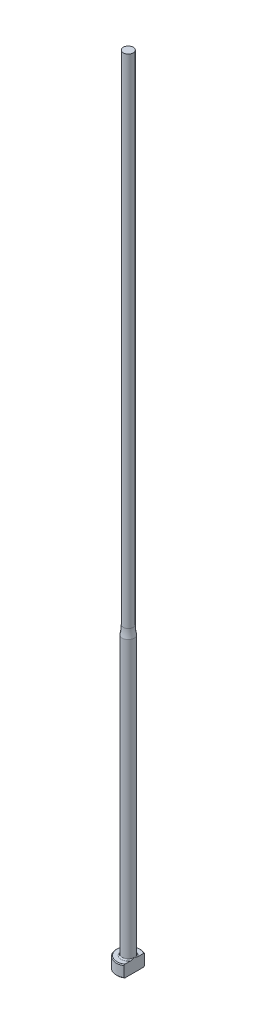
from build123d import *
from build123d.topology import SkipClean

# Parameters (mm, degrees)
CHAMFER1_SIZE = 0.2
FILLET1_R     = 0.3
KEY_DEPTH     = 201.044994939


with BuildPart() as part:
    # Sketch1 → Revolve1 (revolve)
    with BuildSketch(Plane.XY, mode=Mode.PRIVATE) as revolve1_sk:
        with BuildLine():
            Line((0, 0), (-3, 0))
            Line((-3, 0), (-3, 3))
            Line((-3, 3), (-1.5, 3))
            Line((-1.5, 3), (-1.5, 72.777951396))
            ThreePointArc((-1.5, 72.777951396), (-1.312696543, 73.881966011), (-1.25, 75))
            Line((-1.25, 75), (-1.25, 200))
            Line((-1.25, 200), (0, 200))
            Line((0, 200), (0, 0))
        make_face()
    revolve(revolve1_sk.sketch.rotate(Axis((0, 259.958771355, 0), (0, -1, 0)), 270), axis=Axis((0, 259.958771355, 0), (0, -1, 0)))

    # Chamfer1
    chamfer1_edges = [part.edges().sort_by_distance(p)[0] for p in [
        (0, 0, -3),
        (0, 3, -3),
    ]]
    chamfer(chamfer1_edges, length=CHAMFER1_SIZE)

    # Fillet1
    fillet1_edges = [part.edges().sort_by_distance(p)[0] for p in [
        (0, 3, -1.5),
    ]]
    fillet(fillet1_edges, radius=FILLET1_R)

    # Sketch2 → KEY (cut, through all)
    with SkipClean():  # the faces are left unmerged after this step: merging them gives an invalid solid
        with BuildSketch(Plane(origin=(0, 0, 0), x_dir=(1, 0, 0), z_dir=(0, 1, 0))):
            with BuildLine():
                Line((1.5, 2.598076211), (1.5, -2.598076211))
                ThreePointArc((1.5, -2.598076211), (3, 0), (1.5, 2.598076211))
            make_face()
        extrude(amount=KEY_DEPTH, mode=Mode.SUBTRACT)


solid = part.part
